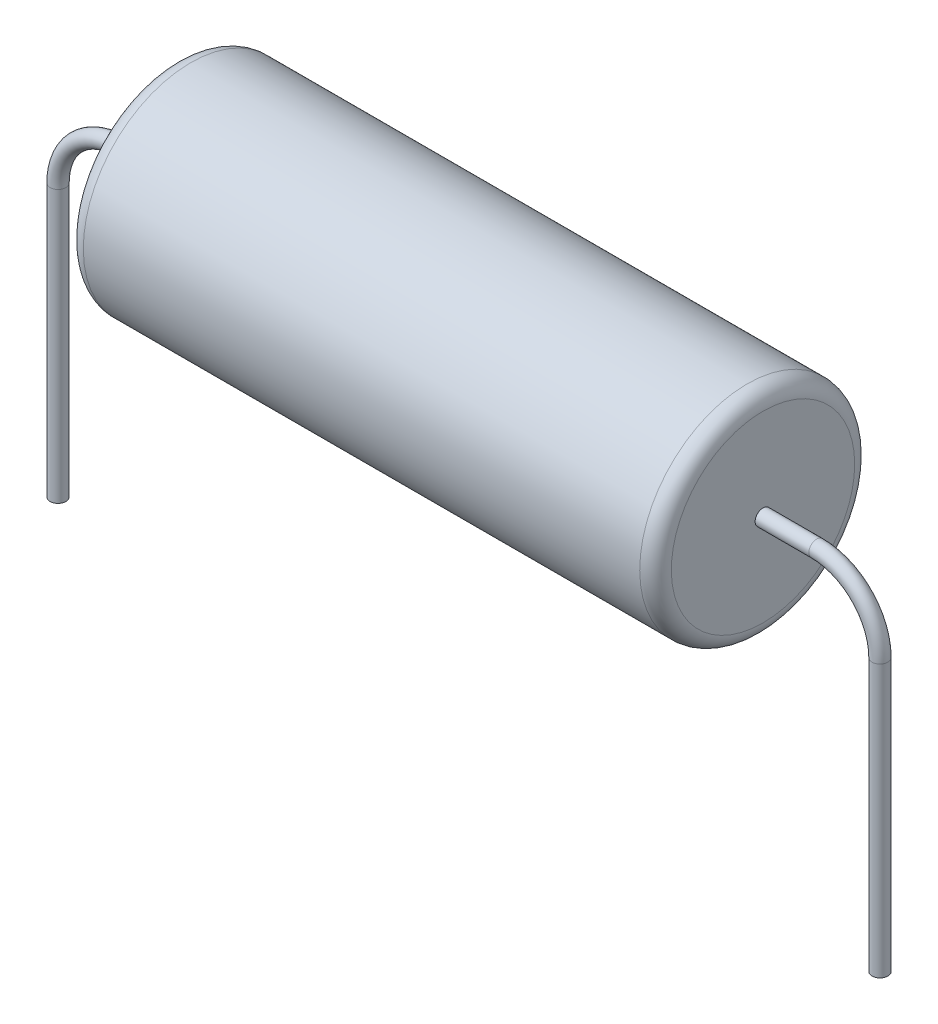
ISO-10303-21;
HEADER;
FILE_DESCRIPTION(('STEP AP214'),'2;1');
FILE_NAME('part.step','',(''),(''),'','','');
FILE_SCHEMA(('AUTOMOTIVE_DESIGN { 1 0 10303 214 1 1 1 1 }'));
ENDSEC;
DATA;
#1=APPLICATION_CONTEXT('core data for automotive mechanical design processes');
#2=APPLICATION_PROTOCOL_DEFINITION('international standard','automotive_design',2000,#1);
#3=PRODUCT_CONTEXT('',#1,'mechanical');
#4=PRODUCT('Part','Part','',(#3));
#5=PRODUCT_RELATED_PRODUCT_CATEGORY('part','',(#4));
#6=PRODUCT_DEFINITION_FORMATION('','',#4);
#7=PRODUCT_DEFINITION_CONTEXT('part definition',#1,'design');
#8=PRODUCT_DEFINITION('design','',#6,#7);
#9=PRODUCT_DEFINITION_SHAPE('','',#8);
#10=(LENGTH_UNIT() NAMED_UNIT(*) SI_UNIT(.MILLI.,.METRE.));
#11=(NAMED_UNIT(*) PLANE_ANGLE_UNIT() SI_UNIT($,.RADIAN.));
#12=(NAMED_UNIT(*) SI_UNIT($,.STERADIAN.) SOLID_ANGLE_UNIT());
#13=UNCERTAINTY_MEASURE_WITH_UNIT(LENGTH_MEASURE(1.E-05),#10,'distance_accuracy_value','');
#14=(GEOMETRIC_REPRESENTATION_CONTEXT(3) GLOBAL_UNCERTAINTY_ASSIGNED_CONTEXT((#13)) GLOBAL_UNIT_ASSIGNED_CONTEXT((#10,
#11,#12)) REPRESENTATION_CONTEXT('',''));
#15=CARTESIAN_POINT('',(0.,0.,0.));
#16=DIRECTION('',(0.,0.,1.));
#17=DIRECTION('',(1.,0.,0.));
#18=AXIS2_PLACEMENT_3D('',#15,#16,#17);
#19=CARTESIAN_POINT('',(43.0363364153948,0.,-43.5456413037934));
#20=DIRECTION('',(0.,1.,0.));
#21=DIRECTION('',(-1.,0.,0.));
#22=AXIS2_PLACEMENT_3D('',#19,#20,#21);
#23=PLANE('',#22);
#24=CARTESIAN_POINT('',(42.672,0.,-43.18));
#25=DIRECTION('',(0.,1.,0.));
#26=DIRECTION('',(0.,0.,1.));
#27=AXIS2_PLACEMENT_3D('',#24,#25,#26);
#28=CIRCLE('',#27,0.317500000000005);
#29=CARTESIAN_POINT('',(42.672,0.,-42.8625));
#30=VERTEX_POINT('',#29);
#31=EDGE_CURVE('E101',#30,#30,#28,.F.);
#32=ORIENTED_EDGE('',*,*,#31,.T.);
#33=EDGE_LOOP('',(#32));
#34=FACE_BOUND('',#33,.T.);
#35=ADVANCED_FACE('F16',(#34),#23,.F.);
#36=CARTESIAN_POINT('',(42.672,0.,-43.18));
#37=DIRECTION('',(0.,1.,0.));
#38=DIRECTION('',(0.,0.,1.));
#39=AXIS2_PLACEMENT_3D('',#36,#37,#38);
#40=CYLINDRICAL_SURFACE('',#39,0.317500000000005);
#41=CARTESIAN_POINT('',(42.672,10.9219999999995,-43.18));
#42=DIRECTION('',(-2.07068036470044E-13,-1.,0.));
#43=DIRECTION('',(0.989139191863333,-2.04819110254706E-13,-0.146981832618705));
#44=AXIS2_PLACEMENT_3D('',#41,#42,#43);
#45=CIRCLE('',#44,0.3175);
#46=CARTESIAN_POINT('',(42.9860516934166,10.9219999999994,-43.2266667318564));
#47=VERTEX_POINT('',#46);
#48=EDGE_CURVE('E99',#47,#47,#45,.T.);
#49=ORIENTED_EDGE('',*,*,#48,.T.);
#50=EDGE_LOOP('',(#49));
#51=FACE_BOUND('',#50,.T.);
#52=ORIENTED_EDGE('',*,*,#31,.F.);
#53=EDGE_LOOP('',(#52));
#54=FACE_BOUND('',#53,.T.);
#55=ADVANCED_FACE('F84',(#51,#54),#40,.T.);
#56=CARTESIAN_POINT('',(40.132,10.922,-43.18));
#57=DIRECTION('',(0.,0.,1.));
#58=DIRECTION('',(-1.,0.,0.));
#59=AXIS2_PLACEMENT_3D('',#56,#57,#58);
#60=TOROIDAL_SURFACE('',#59,2.54000000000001,0.3175);
#61=CARTESIAN_POINT('',(40.132,13.462,-43.18));
#62=DIRECTION('',(-1.,0.,0.));
#63=DIRECTION('',(0.,-1.,0.));
#64=AXIS2_PLACEMENT_3D('',#61,#62,#63);
#65=CIRCLE('',#64,0.317500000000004);
#66=CARTESIAN_POINT('',(40.132,13.1445,-43.18));
#67=VERTEX_POINT('',#66);
#68=EDGE_CURVE('E97',#67,#67,#65,.F.);
#69=ORIENTED_EDGE('',*,*,#68,.T.);
#70=EDGE_LOOP('',(#69));
#71=FACE_BOUND('',#70,.T.);
#72=ORIENTED_EDGE('',*,*,#48,.F.);
#73=EDGE_LOOP('',(#72));
#74=FACE_BOUND('',#73,.T.);
#75=ADVANCED_FACE('F80',(#71,#74),#60,.T.);
#76=CARTESIAN_POINT('',(9.28766358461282,0.,-43.5456413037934));
#77=DIRECTION('',(0.,-1.,0.));
#78=DIRECTION('',(1.,0.,0.));
#79=AXIS2_PLACEMENT_3D('',#76,#77,#78);
#80=PLANE('',#79);
#81=CARTESIAN_POINT('',(9.652,3.46944695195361E-13,-43.18));
#82=DIRECTION('',(0.,-1.,0.));
#83=DIRECTION('',(0.,0.,-1.));
#84=AXIS2_PLACEMENT_3D('',#81,#82,#83);
#85=CIRCLE('',#84,0.3175);
#86=CARTESIAN_POINT('',(9.652,3.46944695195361E-13,-43.4975));
#87=VERTEX_POINT('',#86);
#88=EDGE_CURVE('E104',#87,#87,#85,.T.);
#89=ORIENTED_EDGE('',*,*,#88,.T.);
#90=EDGE_LOOP('',(#89));
#91=FACE_BOUND('',#90,.T.);
#92=ADVANCED_FACE('F75',(#91),#80,.T.);
#93=CARTESIAN_POINT('',(40.132,13.462,-43.18));
#94=DIRECTION('',(-1.,0.,0.));
#95=DIRECTION('',(0.,0.,1.));
#96=AXIS2_PLACEMENT_3D('',#93,#94,#95);
#97=CYLINDRICAL_SURFACE('',#96,0.317500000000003);
#98=ORIENTED_EDGE('',*,*,#68,.F.);
#99=EDGE_LOOP('',(#98));
#100=FACE_BOUND('',#99,.T.);
#101=CARTESIAN_POINT('',(37.973,13.462,-43.18));
#102=DIRECTION('',(-1.,0.,0.));
#103=DIRECTION('',(0.,0.,1.));
#104=AXIS2_PLACEMENT_3D('',#101,#102,#103);
#105=CIRCLE('',#104,0.317500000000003);
#106=CARTESIAN_POINT('',(37.973,13.462,-42.8625));
#107=VERTEX_POINT('',#106);
#108=EDGE_CURVE('E159',#107,#107,#105,.T.);
#109=ORIENTED_EDGE('',*,*,#108,.F.);
#110=EDGE_LOOP('',(#109));
#111=FACE_BOUND('',#110,.T.);
#112=ADVANCED_FACE('F79',(#100,#111),#97,.T.);
#113=CARTESIAN_POINT('',(9.652,10.922,-43.18));
#114=DIRECTION('',(0.,-1.,0.));
#115=DIRECTION('',(0.,0.,-1.));
#116=AXIS2_PLACEMENT_3D('',#113,#114,#115);
#117=CYLINDRICAL_SURFACE('',#116,0.3175);
#118=ORIENTED_EDGE('',*,*,#88,.F.);
#119=EDGE_LOOP('',(#118));
#120=FACE_BOUND('',#119,.T.);
#121=CARTESIAN_POINT('',(9.652,10.9220000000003,-43.18));
#122=DIRECTION('',(1.03212393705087E-13,1.,0.));
#123=DIRECTION('',(0.989139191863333,-1.0209142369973E-13,0.146981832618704));
#124=AXIS2_PLACEMENT_3D('',#121,#122,#123);
#125=CIRCLE('',#124,0.3175);
#126=CARTESIAN_POINT('',(9.96605169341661,10.9220000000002,-43.1333332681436));
#127=VERTEX_POINT('',#126);
#128=EDGE_CURVE('E52',#127,#127,#125,.F.);
#129=ORIENTED_EDGE('',*,*,#128,.T.);
#130=EDGE_LOOP('',(#129));
#131=FACE_BOUND('',#130,.T.);
#132=ADVANCED_FACE('F73',(#120,#131),#117,.T.);
#133=CARTESIAN_POINT('',(37.973,17.29232,-39.3458357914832));
#134=DIRECTION('',(1.,0.,0.));
#135=DIRECTION('',(0.,-1.,0.));
#136=AXIS2_PLACEMENT_3D('',#133,#134,#135);
#137=PLANE('',#136);
#138=ORIENTED_EDGE('',*,*,#108,.T.);
#139=EDGE_LOOP('',(#138));
#140=FACE_BOUND('',#139,.T.);
#141=CARTESIAN_POINT('',(37.973,13.462,-43.18));
#142=DIRECTION('',(-1.,0.,0.));
#143=DIRECTION('',(0.,1.,-7.53613239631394E-13));
#144=AXIS2_PLACEMENT_3D('',#141,#142,#143);
#145=CIRCLE('',#144,3.68300000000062);
#146=CARTESIAN_POINT('',(37.973,9.77899999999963,-43.1799999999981));
#147=VERTEX_POINT('',#146);
#148=CARTESIAN_POINT('',(37.973,17.1450000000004,-43.1800000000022));
#149=VERTEX_POINT('',#148);
#150=EDGE_CURVE('E48',#147,#149,#145,.F.);
#151=ORIENTED_EDGE('',*,*,#150,.T.);
#152=CARTESIAN_POINT('',(37.973,9.77899999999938,-43.1799999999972));
#153=CARTESIAN_POINT('',(37.973,9.77899966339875,-43.1546265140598));
#154=CARTESIAN_POINT('',(37.9729999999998,9.77926165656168,-43.1292530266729));
#155=CARTESIAN_POINT('',(37.9729999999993,9.78031000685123,-43.0785168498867));
#156=CARTESIAN_POINT('',(37.9729999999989,9.78109636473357,-43.0531541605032));
#157=CARTESIAN_POINT('',(37.9729999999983,9.78319315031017,-43.0024504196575));
#158=CARTESIAN_POINT('',(37.972999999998,9.78450357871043,-42.9771093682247));
#159=CARTESIAN_POINT('',(37.9729999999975,9.78764792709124,-42.926459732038));
#160=CARTESIAN_POINT('',(37.9729999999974,9.78948184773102,-42.9011511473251));
#161=CARTESIAN_POINT('',(37.9729999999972,9.79367239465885,-42.8505772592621));
#162=CARTESIAN_POINT('',(37.9729999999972,9.79602902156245,-42.825311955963));
#163=CARTESIAN_POINT('',(37.9729999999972,9.80126396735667,-42.774835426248));
#164=CARTESIAN_POINT('',(37.9729999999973,9.80414228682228,-42.7496241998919));
#165=CARTESIAN_POINT('',(37.9729999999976,9.81041938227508,-42.6992665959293));
#166=CARTESIAN_POINT('',(37.9729999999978,9.81381815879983,-42.6741202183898));
#167=CARTESIAN_POINT('',(37.9729999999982,9.82113471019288,-42.6239030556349));
#168=CARTESIAN_POINT('',(37.9729999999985,9.82505248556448,-42.5988322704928));
#169=CARTESIAN_POINT('',(37.9729999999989,9.83340535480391,-42.5487770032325));
#170=CARTESIAN_POINT('',(37.9729999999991,9.83784044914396,-42.5237925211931));
#171=CARTESIAN_POINT('',(37.9729999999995,9.84722605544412,-42.4739205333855));
#172=CARTESIAN_POINT('',(37.9729999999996,9.85217656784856,-42.4490330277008));
#173=CARTESIAN_POINT('',(37.9729999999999,9.86259088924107,-42.399365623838));
#174=CARTESIAN_POINT('',(37.9729999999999,9.86805469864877,-42.3745857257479));
#175=CARTESIAN_POINT('',(37.973,9.87949327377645,-42.3251441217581));
#176=CARTESIAN_POINT('',(37.973,9.88546803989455,-42.3004824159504));
#177=CARTESIAN_POINT('',(37.9729999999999,9.8979259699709,-42.2512877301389));
#178=CARTESIAN_POINT('',(37.9729999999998,9.90440913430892,-42.2267547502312));
#179=CARTESIAN_POINT('',(37.9729999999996,9.91788108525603,-42.177827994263));
#180=CARTESIAN_POINT('',(37.9729999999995,9.92486987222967,-42.1534342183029));
#181=CARTESIAN_POINT('',(37.9729999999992,9.93935007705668,-42.1047962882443));
#182=CARTESIAN_POINT('',(37.9729999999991,9.94684149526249,-42.0805521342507));
#183=CARTESIAN_POINT('',(37.9729999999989,9.96232375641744,-42.0322238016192));
#184=CARTESIAN_POINT('',(37.9729999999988,9.97031459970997,-42.0081396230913));
#185=CARTESIAN_POINT('',(37.9729999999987,9.98679229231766,-41.9601415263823));
#186=CARTESIAN_POINT('',(37.9729999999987,9.99527914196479,-41.9362276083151));
#187=CARTESIAN_POINT('',(37.9729999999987,10.0127452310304,-41.8885802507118));
#188=CARTESIAN_POINT('',(37.9729999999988,10.0217244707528,-41.864846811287));
#189=CARTESIAN_POINT('',(37.9729999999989,10.0401715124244,-41.8175705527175));
#190=CARTESIAN_POINT('',(37.972999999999,10.0496393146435,-41.7940277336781));
#191=CARTESIAN_POINT('',(37.9729999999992,10.069059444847,-41.7471427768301));
#192=CARTESIAN_POINT('',(37.9729999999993,10.0790117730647,-41.723800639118));
#193=CARTESIAN_POINT('',(37.9729999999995,10.0993967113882,-41.6773270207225));
#194=CARTESIAN_POINT('',(37.9729999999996,10.1098293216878,-41.6541955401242));
#195=CARTESIAN_POINT('',(37.9729999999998,10.1311703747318,-41.608153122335));
#196=CARTESIAN_POINT('',(37.9729999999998,10.1420788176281,-41.5852421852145));
#197=CARTESIAN_POINT('',(37.9729999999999,10.1643668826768,-41.5396506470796));
#198=CARTESIAN_POINT('',(37.9729999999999,10.1757465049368,-41.5169700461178));
#199=CARTESIAN_POINT('',(37.973,10.1989720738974,-41.47184887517));
#200=CARTESIAN_POINT('',(37.973,10.2108180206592,-41.4494083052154));
#201=CARTESIAN_POINT('',(37.973,10.2349711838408,-41.4047767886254));
#202=CARTESIAN_POINT('',(37.973,10.24727840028,-41.3825858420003));
#203=CARTESIAN_POINT('',(37.973,10.2723488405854,-41.338463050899));
#204=CARTESIAN_POINT('',(37.973,10.2851120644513,-41.3165312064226));
#205=CARTESIAN_POINT('',(37.973,10.3110890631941,-41.2729359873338));
#206=CARTESIAN_POINT('',(37.973,10.3243028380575,-41.2512726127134));
#207=CARTESIAN_POINT('',(37.973,10.3511752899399,-41.2082235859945));
#208=CARTESIAN_POINT('',(37.973,10.3648339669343,-41.1868379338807));
#209=CARTESIAN_POINT('',(37.973,10.3925903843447,-41.1443534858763));
#210=CARTESIAN_POINT('',(37.973,10.4066881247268,-41.1232546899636));
#211=CARTESIAN_POINT('',(37.973,10.4353166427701,-41.0813529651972));
#212=CARTESIAN_POINT('',(37.973,10.4498474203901,-41.0605500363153));
#213=CARTESIAN_POINT('',(37.9729999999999,10.4793358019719,-41.0192489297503));
#214=CARTESIAN_POINT('',(37.9729999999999,10.4942934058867,-40.9987507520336));
#215=CARTESIAN_POINT('',(37.9729999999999,10.5246290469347,-40.9580679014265));
#216=CARTESIAN_POINT('',(37.9729999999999,10.5400070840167,-40.937883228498));
#217=CARTESIAN_POINT('',(37.9729999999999,10.5711770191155,-40.8978360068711));
#218=CARTESIAN_POINT('',(37.9729999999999,10.5869689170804,-40.8779734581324));
#219=CARTESIAN_POINT('',(37.9729999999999,10.618959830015,-40.8385789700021));
#220=CARTESIAN_POINT('',(37.9729999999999,10.6351588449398,-40.8190470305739));
#221=CARTESIAN_POINT('',(37.9729999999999,10.6679570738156,-40.7803221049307));
#222=CARTESIAN_POINT('',(37.9729999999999,10.6845562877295,-40.7611291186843));
#223=CARTESIAN_POINT('',(37.9729999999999,10.7181478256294,-40.7230902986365));
#224=CARTESIAN_POINT('',(37.9729999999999,10.7351401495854,-40.7042444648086));
#225=CARTESIAN_POINT('',(37.9729999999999,10.7695106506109,-40.6669080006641));
#226=CARTESIAN_POINT('',(37.9729999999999,10.7868888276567,-40.6484173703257));
#227=CARTESIAN_POINT('',(37.9729999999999,10.8220236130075,-40.6117992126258));
#228=CARTESIAN_POINT('',(37.9729999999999,10.8397802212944,-40.593671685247));
#229=CARTESIAN_POINT('',(37.9729999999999,10.8756642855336,-40.5577874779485));
#230=CARTESIAN_POINT('',(37.973,10.8937917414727,-40.5400307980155));
#231=CARTESIAN_POINT('',(37.973,10.930409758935,-40.504895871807));
#232=CARTESIAN_POINT('',(37.973,10.9489003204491,-40.487517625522));
#233=CARTESIAN_POINT('',(37.973,10.9862366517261,-40.4531469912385));
#234=CARTESIAN_POINT('',(37.973,11.005082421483,-40.4361546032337));
#235=CARTESIAN_POINT('',(37.973,11.0431211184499,-40.4025629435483));
#236=CARTESIAN_POINT('',(37.973,11.0623140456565,-40.3859636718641));
#237=CARTESIAN_POINT('',(37.973,11.1010388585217,-40.3531653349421));
#238=CARTESIAN_POINT('',(37.973,11.1205707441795,-40.3369662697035));
#239=CARTESIAN_POINT('',(37.973,11.1599651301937,-40.304975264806));
#240=CARTESIAN_POINT('',(37.973,11.1798276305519,-40.2891833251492));
#241=CARTESIAN_POINT('',(37.973,11.2198747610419,-40.2580133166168));
#242=CARTESIAN_POINT('',(37.973,11.240059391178,-40.2426352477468));
#243=CARTESIAN_POINT('',(37.973,11.2807421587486,-40.2122995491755));
#244=CARTESIAN_POINT('',(37.973,11.3012402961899,-40.1973419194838));
#245=CARTESIAN_POINT('',(37.973,11.3425413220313,-40.1678534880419));
#246=CARTESIAN_POINT('',(37.973,11.363344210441,-40.1533226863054));
#247=CARTESIAN_POINT('',(37.973,11.4052458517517,-40.1246941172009));
#248=CARTESIAN_POINT('',(37.973,11.426344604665,-40.1105963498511));
#249=CARTESIAN_POINT('',(37.973,11.468828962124,-40.0828398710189));
#250=CARTESIAN_POINT('',(37.973,11.4902145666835,-40.0691811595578));
#251=CARTESIAN_POINT('',(37.973,11.5332634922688,-40.0423086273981));
#252=CARTESIAN_POINT('',(37.973,11.5549268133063,-40.0290948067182));
#253=CARTESIAN_POINT('',(37.973,11.5985219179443,-40.0031177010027));
#254=CARTESIAN_POINT('',(37.973,11.6204537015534,-39.9903544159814));
#255=CARTESIAN_POINT('',(37.973,11.6645763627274,-39.9652838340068));
#256=CARTESIAN_POINT('',(37.973,11.686767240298,-39.9529765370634));
#257=CARTESIAN_POINT('',(37.973,11.7313986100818,-39.9288231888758));
#258=CARTESIAN_POINT('',(37.973,11.7538391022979,-39.9169771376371));
#259=CARTESIAN_POINT('',(37.973,11.7989601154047,-39.8937513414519));
#260=CARTESIAN_POINT('',(37.973,11.8216406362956,-39.8823715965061));
#261=CARTESIAN_POINT('',(37.973,11.8672320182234,-39.8600832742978));
#262=CARTESIAN_POINT('',(37.973,11.8901428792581,-39.8491746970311));
#263=CARTESIAN_POINT('',(37.973,11.9361851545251,-39.8278333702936));
#264=CARTESIAN_POINT('',(37.973,11.9593165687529,-39.8174006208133));
#265=CARTESIAN_POINT('',(37.973,12.0057900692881,-39.7970154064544));
#266=CARTESIAN_POINT('',(37.973,12.0291321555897,-39.7870629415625));
#267=CARTESIAN_POINT('',(37.973,12.076017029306,-39.7676425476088));
#268=CARTESIAN_POINT('',(37.973,12.099559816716,-39.7581746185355));
#269=CARTESIAN_POINT('',(37.973,12.1468360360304,-39.7397273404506));
#270=CARTESIAN_POINT('',(37.973,12.1705694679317,-39.7307479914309));
#271=CARTESIAN_POINT('',(37.973,12.2182168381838,-39.7132817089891));
#272=CARTESIAN_POINT('',(37.973,12.242130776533,-39.7047947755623));
#273=CARTESIAN_POINT('',(37.973,12.2901289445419,-39.6883169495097));
#274=CARTESIAN_POINT('',(37.973,12.3142131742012,-39.6803260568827));
#275=CARTESIAN_POINT('',(37.973,12.362541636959,-39.6648437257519));
#276=CARTESIAN_POINT('',(37.973,12.3867858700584,-39.6573522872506));
#277=CARTESIAN_POINT('',(37.973,12.4354239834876,-39.6428720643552));
#278=CARTESIAN_POINT('',(37.973,12.4598178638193,-39.6358832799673));
#279=CARTESIAN_POINT('',(37.973,12.5087448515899,-39.6224113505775));
#280=CARTESIAN_POINT('',(37.973,12.5332779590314,-39.6159282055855));
#281=CARTESIAN_POINT('',(37.973,12.5824729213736,-39.6034703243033));
#282=CARTESIAN_POINT('',(37.973,12.6071347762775,-39.5974955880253));
#283=CARTESIAN_POINT('',(37.973,12.6565766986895,-39.5860570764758));
#284=CARTESIAN_POINT('',(37.973,12.6813567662,-39.5805933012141));
#285=CARTESIAN_POINT('',(37.973,12.7310245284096,-39.5701790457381));
#286=CARTESIAN_POINT('',(37.973,12.7559122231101,-39.5652285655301));
#287=CARTESIAN_POINT('',(37.973,12.8057846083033,-39.5558430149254));
#288=CARTESIAN_POINT('',(37.973,12.8307692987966,-39.5514079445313));
#289=CARTESIAN_POINT('',(37.973,12.8808250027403,-39.5430551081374));
#290=CARTESIAN_POINT('',(37.973,12.9058960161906,-39.5391373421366));
#291=CARTESIAN_POINT('',(37.973,12.9561136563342,-39.5318207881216));
#292=CARTESIAN_POINT('',(37.973,12.9812602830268,-39.5284220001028));
#293=CARTESIAN_POINT('',(37.973,13.0316184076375,-39.5221448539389));
#294=CARTESIAN_POINT('',(37.973,13.0568299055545,-39.5192664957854));
#295=CARTESIAN_POINT('',(37.973,13.1073070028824,-39.5140314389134));
#296=CARTESIAN_POINT('',(37.973,13.1325726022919,-39.5116747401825));
#297=CARTESIAN_POINT('',(37.973,13.1831471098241,-39.5074840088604));
#298=CARTESIAN_POINT('',(37.973,13.2084560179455,-39.5056499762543));
#299=CARTESIAN_POINT('',(37.973,13.2591063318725,-39.5025053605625));
#300=CARTESIAN_POINT('',(37.973,13.2844477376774,-39.5011947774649));
#301=CARTESIAN_POINT('',(37.973,13.3351522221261,-39.4990976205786));
#302=CARTESIAN_POINT('',(37.973,13.3605153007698,-39.498311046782));
#303=CARTESIAN_POINT('',(37.973,13.4112522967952,-39.4972622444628));
#304=CARTESIAN_POINT('',(37.973,13.4366262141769,-39.4970000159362));
#305=CARTESIAN_POINT('',(37.973,13.4873740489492,-39.4970000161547));
#306=CARTESIAN_POINT('',(37.973,13.5127479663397,-39.4972622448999));
#307=CARTESIAN_POINT('',(37.973,13.5634849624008,-39.4983110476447));
#308=CARTESIAN_POINT('',(37.973,13.5888480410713,-39.4990976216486));
#309=CARTESIAN_POINT('',(37.973,13.6395525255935,-39.5011947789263));
#310=CARTESIAN_POINT('',(37.973,13.6648939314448,-39.5025053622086));
#311=CARTESIAN_POINT('',(37.973,13.7155442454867,-39.5056499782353));
#312=CARTESIAN_POINT('',(37.973,13.7408531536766,-39.5074840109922));
#313=CARTESIAN_POINT('',(37.973,13.7914276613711,-39.5116747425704));
#314=CARTESIAN_POINT('',(37.973,13.8166932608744,-39.514031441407));
#315=CARTESIAN_POINT('',(37.973,13.8671703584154,-39.5192664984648));
#316=CARTESIAN_POINT('',(37.973,13.8923818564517,-39.5221448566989));
#317=CARTESIAN_POINT('',(37.973,13.9427399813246,-39.5284220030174));
#318=CARTESIAN_POINT('',(37.973,13.96788660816,-39.531820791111));
#319=CARTESIAN_POINT('',(37.973,14.0181042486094,-39.5391373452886));
#320=CARTESIAN_POINT('',(37.973,14.0431752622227,-39.5430551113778));
#321=CARTESIAN_POINT('',(37.973,14.0932309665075,-39.5514079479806));
#322=CARTESIAN_POINT('',(37.973,14.1182156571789,-39.5558430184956));
#323=CARTESIAN_POINT('',(37.973,14.1680880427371,-39.565228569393));
#324=CARTESIAN_POINT('',(37.973,14.1929757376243,-39.5701790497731));
#325=CARTESIAN_POINT('',(37.973,14.2426435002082,-39.5805933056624));
#326=CARTESIAN_POINT('',(37.973,14.2674235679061,-39.5860570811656));
#327=CARTESIAN_POINT('',(37.973,14.3168654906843,-39.5974955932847));
#328=CARTESIAN_POINT('',(37.973,14.3415273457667,-39.603470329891));
#329=CARTESIAN_POINT('',(37.973,14.3907223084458,-39.6159282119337));
#330=CARTESIAN_POINT('',(37.973,14.4152554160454,-39.622411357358));
#331=CARTESIAN_POINT('',(37.973,14.4641824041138,-39.6358832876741));
#332=CARTESIAN_POINT('',(37.973,14.4885762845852,-39.6428720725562));
#333=CARTESIAN_POINT('',(37.973,14.537214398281,-39.6573522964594));
#334=CARTESIAN_POINT('',(37.973,14.5614586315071,-39.6648437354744));
#335=CARTESIAN_POINT('',(37.973,14.6097870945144,-39.6803260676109));
#336=CARTESIAN_POINT('',(37.973,14.6338713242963,-39.6883169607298));
#337=CARTESIAN_POINT('',(37.973,14.6818694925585,-39.7047947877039));
#338=CARTESIAN_POINT('',(37.973,14.7057834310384,-39.7132817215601));
#339=CARTESIAN_POINT('',(37.973,14.7534308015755,-39.7307480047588));
#340=CARTESIAN_POINT('',(37.973,14.7771642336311,-39.7397273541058));
#341=CARTESIAN_POINT('',(37.973,14.8244404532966,-39.7581746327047));
#342=CARTESIAN_POINT('',(37.973,14.8479832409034,-39.7676425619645));
#343=CARTESIAN_POINT('',(37.973,14.8948681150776,-39.7870629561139));
#344=CARTESIAN_POINT('',(37.973,14.9182102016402,-39.7970154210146));
#345=CARTESIAN_POINT('',(37.973,14.9646837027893,-39.8174006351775));
#346=CARTESIAN_POINT('',(37.973,14.9878151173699,-39.8278333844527));
#347=CARTESIAN_POINT('',(37.973,15.0338573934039,-39.8491747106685));
#348=CARTESIAN_POINT('',(37.973,15.0567682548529,-39.8600832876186));
#349=CARTESIAN_POINT('',(37.973,15.1023596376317,-39.8823716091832));
#350=CARTESIAN_POINT('',(37.973,15.1250401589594,-39.893751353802));
#351=CARTESIAN_POINT('',(37.973,15.1701611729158,-39.9169771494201));
#352=CARTESIAN_POINT('',(37.973,15.1926016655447,-39.9288232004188));
#353=CARTESIAN_POINT('',(37.973,15.2372330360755,-39.9529765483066));
#354=CARTESIAN_POINT('',(37.973,15.2594239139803,-39.9652838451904));
#355=CARTESIAN_POINT('',(37.973,15.3035465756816,-39.990354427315));
#356=CARTESIAN_POINT('',(37.973,15.3254783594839,-40.0031177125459));
#357=CARTESIAN_POINT('',(37.973,15.369073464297,-40.0290948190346));
#358=CARTESIAN_POINT('',(37.973,15.3907367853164,-40.042308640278));
#359=CARTESIAN_POINT('',(37.973,15.4337857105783,-40.0691811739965));
#360=CARTESIAN_POINT('',(37.973,15.4551713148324,-40.082839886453));
#361=CARTESIAN_POINT('',(37.973,15.4976556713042,-40.1105963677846));
#362=CARTESIAN_POINT('',(37.973,15.5187544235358,-40.1246941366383));
#363=CARTESIAN_POINT('',(37.973,15.5606560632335,-40.1533227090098));
#364=CARTESIAN_POINT('',(37.973,15.5814589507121,-40.1678535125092));
#365=CARTESIAN_POINT('',(37.973,15.6227599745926,-40.1973419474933));
#366=CARTESIAN_POINT('',(37.973,15.6432581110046,-40.212299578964));
#367=CARTESIAN_POINT('',(37.973,15.6839408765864,-40.2426352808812));
#368=CARTESIAN_POINT('',(37.973,15.7041255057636,-40.2580133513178));
#369=CARTESIAN_POINT('',(37.973,15.7441726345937,-40.2891833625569));
#370=CARTESIAN_POINT('',(37.973,15.7640351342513,-40.3049753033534));
#371=CARTESIAN_POINT('',(37.973,15.8034295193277,-40.3369663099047));
#372=CARTESIAN_POINT('',(37.973,15.8229614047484,-40.3531653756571));
#373=CARTESIAN_POINT('',(37.973,15.8616862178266,-40.385963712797));
#374=CARTESIAN_POINT('',(37.973,15.8808791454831,-40.4025629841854));
#375=CARTESIAN_POINT('',(37.973,15.9189178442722,-40.4361546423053));
#376=CARTESIAN_POINT('',(37.973,15.9377636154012,-40.453147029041));
#377=CARTESIAN_POINT('',(37.973,15.9750999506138,-40.4875176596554));
#378=CARTESIAN_POINT('',(37.973,15.993590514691,-40.5048959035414));
#379=CARTESIAN_POINT('',(37.973,16.0302085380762,-40.5400308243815));
#380=CARTESIAN_POINT('',(37.973,16.0483359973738,-40.5577875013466));
#381=CARTESIAN_POINT('',(37.973,16.0842200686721,-40.5936717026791));
#382=CARTESIAN_POINT('',(37.973,16.1019766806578,-40.6117992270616));
#383=CARTESIAN_POINT('',(37.973,16.1371114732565,-40.6484173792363));
#384=CARTESIAN_POINT('',(37.973,16.1544896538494,-40.6669080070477));
#385=CARTESIAN_POINT('',(37.973,16.1888601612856,-40.7042444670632));
#386=CARTESIAN_POINT('',(37.973,16.2058524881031,-40.7230902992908));
#387=CARTESIAN_POINT('',(37.973,16.2394440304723,-40.7611291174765));
#388=CARTESIAN_POINT('',(37.973,16.2560432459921,-40.7803221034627));
#389=CARTESIAN_POINT('',(37.973,16.2888414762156,-40.8190470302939));
#390=CARTESIAN_POINT('',(37.973,16.3050404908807,-40.8385789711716));
#391=CARTESIAN_POINT('',(37.973,16.3370314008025,-40.8779734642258));
#392=CARTESIAN_POINT('',(37.973,16.3528232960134,-40.8978360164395));
#393=CARTESIAN_POINT('',(37.973,16.3839932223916,-40.9378832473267));
#394=CARTESIAN_POINT('',(37.973,16.3993712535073,-40.9580679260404));
#395=CARTESIAN_POINT('',(37.973,16.4297068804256,-40.9987507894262));
#396=CARTESIAN_POINT('',(37.973,16.4446644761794,-41.0192489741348));
#397=CARTESIAN_POINT('',(37.973,16.4741528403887,-41.0605500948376));
#398=CARTESIAN_POINT('',(37.973,16.4886836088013,-41.0813530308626));
#399=CARTESIAN_POINT('',(37.973,16.517312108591,-41.1232547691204));
#400=CARTESIAN_POINT('',(37.973,16.5314098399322,-41.1443535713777));
#401=CARTESIAN_POINT('',(37.973,16.5591662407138,-41.186838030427));
#402=CARTESIAN_POINT('',(37.973,16.5728249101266,-41.2082236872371));
#403=CARTESIAN_POINT('',(37.973,16.5996973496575,-41.2512727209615));
#404=CARTESIAN_POINT('',(37.973,16.6129111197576,-41.272936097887));
#405=CARTESIAN_POINT('',(37.973,16.6388881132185,-41.316531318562));
#406=CARTESIAN_POINT('',(37.973,16.6516513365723,-41.3384631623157));
#407=CARTESIAN_POINT('',(37.973,16.676721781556,-41.3825859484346));
#408=CARTESIAN_POINT('',(37.973,16.6890290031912,-41.4047768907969));
#409=CARTESIAN_POINT('',(37.973,16.7131821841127,-41.4494083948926));
#410=CARTESIAN_POINT('',(37.973,16.725028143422,-41.4718489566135));
#411=CARTESIAN_POINT('',(37.973,16.7482537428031,-41.5169701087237));
#412=CARTESIAN_POINT('',(37.973,16.7596333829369,-41.5396506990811));
#413=CARTESIAN_POINT('',(37.973,16.7819214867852,-41.5852422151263));
#414=CARTESIAN_POINT('',(37.9729999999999,16.7928299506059,-41.6081531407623));
#415=CARTESIAN_POINT('',(37.9729999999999,16.8141710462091,-41.6541955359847));
#416=CARTESIAN_POINT('',(37.9729999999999,16.8246036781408,-41.6773270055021));
#417=CARTESIAN_POINT('',(37.9729999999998,16.8449886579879,-41.7238006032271));
#418=CARTESIAN_POINT('',(37.9729999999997,16.8549410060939,-41.7471427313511));
#419=CARTESIAN_POINT('',(37.9729999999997,16.8743611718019,-41.7940276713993));
#420=CARTESIAN_POINT('',(37.9729999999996,16.8838289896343,-41.817570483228));
#421=CARTESIAN_POINT('',(37.9729999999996,16.9022760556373,-41.8648467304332));
#422=CARTESIAN_POINT('',(37.9729999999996,16.9112553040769,-41.8885801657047));
#423=CARTESIAN_POINT('',(37.9729999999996,16.928721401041,-41.9362275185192));
#424=CARTESIAN_POINT('',(37.9729999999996,16.9372082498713,-41.9601414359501));
#425=CARTESIAN_POINT('',(37.9729999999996,16.9536859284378,-42.0081395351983));
#426=CARTESIAN_POINT('',(37.9729999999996,16.9616767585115,-42.0322237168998));
#427=CARTESIAN_POINT('',(37.9729999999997,16.9771589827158,-42.0805520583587));
#428=CARTESIAN_POINT('',(37.9729999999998,16.9846503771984,-42.1047962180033));
#429=CARTESIAN_POINT('',(37.9729999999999,16.999130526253,-42.1534341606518));
#430=CARTESIAN_POINT('',(37.9729999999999,17.0061192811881,-42.1778279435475));
#431=CARTESIAN_POINT('',(37.973,17.0195911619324,-42.2267547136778));
#432=CARTESIAN_POINT('',(37.973,17.0260742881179,-42.2512877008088));
#433=CARTESIAN_POINT('',(37.973,17.0385321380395,-42.3004824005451));
#434=CARTESIAN_POINT('',(37.973,17.0445068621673,-42.3251441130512));
#435=CARTESIAN_POINT('',(37.9729999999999,17.0559453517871,-42.3745857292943));
#436=CARTESIAN_POINT('',(37.9729999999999,17.0614091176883,-42.3993656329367));
#437=CARTESIAN_POINT('',(37.9729999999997,17.0718233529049,-42.4490330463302));
#438=CARTESIAN_POINT('',(37.9729999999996,17.0767738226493,-42.4739205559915));
#439=CARTESIAN_POINT('',(37.9729999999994,17.0861593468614,-42.5237925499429));
#440=CARTESIAN_POINT('',(37.9729999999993,17.0905944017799,-42.5487770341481));
#441=CARTESIAN_POINT('',(37.9729999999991,17.0989471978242,-42.59883230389));
#442=CARTESIAN_POINT('',(37.972999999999,17.1028649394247,-42.6239030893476));
#443=CARTESIAN_POINT('',(37.9729999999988,17.1101814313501,-42.6741202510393));
#444=CARTESIAN_POINT('',(37.9729999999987,17.113580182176,-42.6992666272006));
#445=CARTESIAN_POINT('',(37.9729999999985,17.1198572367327,-42.749624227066));
#446=CARTESIAN_POINT('',(37.9729999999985,17.1227355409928,-42.7748354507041));
#447=CARTESIAN_POINT('',(37.9729999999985,17.1279704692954,-42.8253119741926));
#448=CARTESIAN_POINT('',(37.9729999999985,17.1303270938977,-42.850577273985));
#449=CARTESIAN_POINT('',(37.9729999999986,17.1345176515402,-42.9011511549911));
#450=CARTESIAN_POINT('',(37.9729999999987,17.1363515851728,-42.9264597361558));
#451=CARTESIAN_POINT('',(37.972999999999,17.1394959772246,-42.9771093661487));
#452=CARTESIAN_POINT('',(37.9729999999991,17.1408064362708,-43.002450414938));
#453=CARTESIAN_POINT('',(37.9729999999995,17.1429033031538,-43.05315415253));
#454=CARTESIAN_POINT('',(37.9729999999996,17.1436897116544,-43.0785168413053));
#455=CARTESIAN_POINT('',(37.9729999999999,17.1447381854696,-43.1292530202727));
#456=CARTESIAN_POINT('',(37.973,17.1450002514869,-43.1546265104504));
#457=CARTESIAN_POINT('',(37.973,17.1450000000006,-43.180000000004));
#458=B_SPLINE_CURVE_WITH_KNOTS('',3,(#152,#153,#154,#155,#156,#157,#158,#159,#160,#161,#162,
#163,#164,#165,#166,#167,#168,#169,#170,#171,#172,#173,#174,#175,#176,#177,#178,#179,#180,#181,
#182,#183,#184,#185,#186,#187,#188,#189,#190,#191,#192,#193,#194,#195,#196,#197,#198,#199,#200,
#201,#202,#203,#204,#205,#206,#207,#208,#209,#210,#211,#212,#213,#214,#215,#216,#217,#218,#219,
#220,#221,#222,#223,#224,#225,#226,#227,#228,#229,#230,#231,#232,#233,#234,#235,#236,#237,#238,
#239,#240,#241,#242,#243,#244,#245,#246,#247,#248,#249,#250,#251,#252,#253,#254,#255,#256,#257,
#258,#259,#260,#261,#262,#263,#264,#265,#266,#267,#268,#269,#270,#271,#272,#273,#274,#275,#276,
#277,#278,#279,#280,#281,#282,#283,#284,#285,#286,#287,#288,#289,#290,#291,#292,#293,#294,#295,
#296,#297,#298,#299,#300,#301,#302,#303,#304,#305,#306,#307,#308,#309,#310,#311,#312,#313,#314,
#315,#316,#317,#318,#319,#320,#321,#322,#323,#324,#325,#326,#327,#328,#329,#330,#331,#332,#333,
#334,#335,#336,#337,#338,#339,#340,#341,#342,#343,#344,#345,#346,#347,#348,#349,#350,#351,#352,
#353,#354,#355,#356,#357,#358,#359,#360,#361,#362,#363,#364,#365,#366,#367,#368,#369,#370,#371,
#372,#373,#374,#375,#376,#377,#378,#379,#380,#381,#382,#383,#384,#385,#386,#387,#388,#389,#390,
#391,#392,#393,#394,#395,#396,#397,#398,#399,#400,#401,#402,#403,#404,#405,#406,#407,#408,#409,
#410,#411,#412,#413,#414,#415,#416,#417,#418,#419,#420,#421,#422,#423,#424,#425,#426,#427,#428,
#429,#430,#431,#432,#433,#434,#435,#436,#437,#438,#439,#440,#441,#442,#443,#444,#445,#446,#447,
#448,#449,#450,#451,#452,#453,#454,#455,#456,#457),.UNSPECIFIED.,.F.,.F.,(4,2,2,2,2,2,2,2,2,2,2,
2,2,2,2,2,2,2,2,2,2,2,2,2,2,2,2,2,2,2,2,2,2,2,2,2,2,2,2,2,2,2,2,2,2,2,2,2,2,2,2,2,2,2,2,2,2,2,2,
2,2,2,2,2,2,2,2,2,2,2,2,2,2,2,2,2,2,2,2,2,2,2,2,2,2,2,2,2,2,2,2,2,2,2,2,2,2,2,2,2,2,2,2,2,2,2,2,
2,2,2,2,2,2,2,2,2,2,2,2,2,2,2,2,2,2,2,2,2,2,2,2,2,2,2,2,2,2,2,2,2,2,2,2,2,2,2,2,2,2,2,2,2,4),
(0.,0.0761190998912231,0.152238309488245,0.228357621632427,0.304477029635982,0.380596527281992,
0.456716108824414,0.532835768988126,0.608955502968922,0.685075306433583,0.761195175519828,
0.837315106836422,0.913435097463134,0.98955514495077,1.06567524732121,1.14179540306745,
1.21791561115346,1.29403587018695,1.37015617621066,1.44627652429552,1.5223969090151,
1.59851732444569,1.6746377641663,1.75075822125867,1.82687868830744,1.90299915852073,
1.9791196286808,2.05524009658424,2.13136056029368,2.20748101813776,2.28360146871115,
2.35972191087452,2.43584234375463,2.51196276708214,2.58808318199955,2.66420358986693,
2.74032399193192,2.81644438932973,2.89256478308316,2.96868517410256,3.04480556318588,
3.12092595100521,3.19704633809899,3.27316672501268,3.34928711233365,3.42540750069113,
3.50152789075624,3.577648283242,3.65376867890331,3.72988907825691,3.80600948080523,
3.88212988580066,3.95825029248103,4.03437070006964,4.11049110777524,4.186611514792,
4.2627319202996,4.33885232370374,4.41497272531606,4.4910931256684,4.56721352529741,
4.64333392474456,4.71945432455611,4.79557472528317,4.87169512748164,4.94781553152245,
5.02393593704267,5.1000563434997,5.17617675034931,5.2522971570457,5.32841756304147,
5.40453796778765,5.48065837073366,5.55677877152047,5.63289917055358,5.70901956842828,
5.78513996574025,5.86126036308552,5.93738076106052,6.01350116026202,6.0896215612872,
6.16574196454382,6.24186236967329,6.31798277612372,6.39410318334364,6.470223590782,
6.54634399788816,6.62246440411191,6.69858480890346,6.77470521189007,6.8508256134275,
6.92694601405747,7.00306641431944,7.07918681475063,7.15530721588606,7.23142761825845,
7.30754802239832,7.38366842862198,7.45978883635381,7.53590924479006,7.6120296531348,
7.68815006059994,7.76427046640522,7.84039086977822,7.91651126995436,7.99263166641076,
8.06875205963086,8.14487245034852,8.22099283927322,8.29711322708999,8.37323361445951,
8.44935400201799,8.52547439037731,8.60159478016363,8.67771517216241,8.75383556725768,
8.82995596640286,8.90607637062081,8.98219678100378,9.05831719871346,9.13443762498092,
9.21055806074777,9.28667850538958,9.36279895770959,9.43891941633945,9.51503987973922,
9.59116034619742,9.66728081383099,9.7434012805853,9.8195217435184,9.89564219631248,
9.97176263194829,10.0478830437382,10.1240034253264,10.2001237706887,10.2762440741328,
10.3523643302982,10.4284845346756,10.504604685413,10.5807247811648,10.6568448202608,
10.7329648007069,10.8090847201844,10.8852045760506,10.9613243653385,11.0374440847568,
11.1135637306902,11.1896832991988,11.2658027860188,11.3419221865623,11.418041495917,
11.4941607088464,11.5702798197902),.UNSPECIFIED.);
#459=EDGE_CURVE('E45',#149,#147,#458,.F.);
#460=ORIENTED_EDGE('',*,*,#459,.T.);
#461=EDGE_LOOP('',(#151,#460));
#462=FACE_BOUND('',#461,.T.);
#463=ADVANCED_FACE('F55',(#140,#462),#137,.T.);
#464=CARTESIAN_POINT('',(37.338,13.462,-43.18));
#465=DIRECTION('',(1.,0.,0.));
#466=DIRECTION('',(0.,0.999955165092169,-0.00946930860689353));
#467=AXIS2_PLACEMENT_3D('',#464,#465,#466);
#468=TOROIDAL_SURFACE('',#467,3.6830000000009,0.635);
#469=CARTESIAN_POINT('',(37.3379999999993,13.462,-43.18));
#470=DIRECTION('',(1.,0.,0.));
#471=DIRECTION('',(0.,-1.,0.));
#472=AXIS2_PLACEMENT_3D('',#469,#470,#471);
#473=CIRCLE('',#472,4.318);
#474=CARTESIAN_POINT('',(37.3379999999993,9.144,-43.18));
#475=VERTEX_POINT('',#474);
#476=EDGE_CURVE('E56',#475,#475,#473,.T.);
#477=ORIENTED_EDGE('',*,*,#476,.T.);
#478=EDGE_LOOP('',(#477));
#479=FACE_BOUND('',#478,.T.);
#480=ORIENTED_EDGE('',*,*,#150,.F.);
#481=ORIENTED_EDGE('',*,*,#459,.F.);
#482=EDGE_LOOP('',(#480,#481));
#483=FACE_BOUND('',#482,.T.);
#484=ADVANCED_FACE('F49',(#479,#483),#468,.T.);
#485=CARTESIAN_POINT('',(12.192,10.922,-43.18));
#486=DIRECTION('',(0.,0.,1.));
#487=DIRECTION('',(0.,-1.,0.));
#488=AXIS2_PLACEMENT_3D('',#485,#486,#487);
#489=TOROIDAL_SURFACE('',#488,2.54,0.3175);
#490=ORIENTED_EDGE('',*,*,#128,.F.);
#491=EDGE_LOOP('',(#490));
#492=FACE_BOUND('',#491,.T.);
#493=CARTESIAN_POINT('',(12.1920000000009,13.462,-43.18));
#494=DIRECTION('',(-1.,0.,0.));
#495=DIRECTION('',(0.,-1.,0.));
#496=AXIS2_PLACEMENT_3D('',#493,#494,#495);
#497=CIRCLE('',#496,0.317500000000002);
#498=CARTESIAN_POINT('',(12.1920000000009,13.1445,-43.18));
#499=VERTEX_POINT('',#498);
#500=EDGE_CURVE('E138',#499,#499,#497,.T.);
#501=ORIENTED_EDGE('',*,*,#500,.T.);
#502=EDGE_LOOP('',(#501));
#503=FACE_BOUND('',#502,.T.);
#504=ADVANCED_FACE('F146',(#492,#503),#489,.T.);
#505=CARTESIAN_POINT('',(14.986,13.462,-43.18));
#506=DIRECTION('',(1.,0.,0.));
#507=DIRECTION('',(0.,0.,-1.));
#508=AXIS2_PLACEMENT_3D('',#505,#506,#507);
#509=CYLINDRICAL_SURFACE('',#508,4.318);
#510=CARTESIAN_POINT('',(14.986,13.462,-43.18));
#511=DIRECTION('',(1.,0.,0.));
#512=DIRECTION('',(0.,-0.999909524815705,-0.0134514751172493));
#513=AXIS2_PLACEMENT_3D('',#510,#511,#512);
#514=CIRCLE('',#513,4.31800000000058);
#515=CARTESIAN_POINT('',(14.986,9.14439067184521,-43.2380834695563));
#516=VERTEX_POINT('',#515);
#517=EDGE_CURVE('E141',#516,#516,#514,.T.);
#518=ORIENTED_EDGE('',*,*,#517,.T.);
#519=EDGE_LOOP('',(#518));
#520=FACE_BOUND('',#519,.T.);
#521=ORIENTED_EDGE('',*,*,#476,.F.);
#522=EDGE_LOOP('',(#521));
#523=FACE_BOUND('',#522,.T.);
#524=ADVANCED_FACE('F128',(#520,#523),#509,.T.);
#525=CARTESIAN_POINT('',(14.986,13.462,-43.18));
#526=DIRECTION('',(1.,0.,0.));
#527=DIRECTION('',(0.,-0.999909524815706,-0.0134514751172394));
#528=AXIS2_PLACEMENT_3D('',#525,#526,#527);
#529=TOROIDAL_SURFACE('',#528,3.68300000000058,0.635);
#530=ORIENTED_EDGE('',*,*,#517,.F.);
#531=EDGE_LOOP('',(#530));
#532=FACE_BOUND('',#531,.T.);
#533=CARTESIAN_POINT('',(14.351,13.462,-43.18));
#534=DIRECTION('',(1.,0.,0.));
#535=DIRECTION('',(0.,-1.,3.88110818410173E-13));
#536=AXIS2_PLACEMENT_3D('',#533,#534,#535);
#537=CIRCLE('',#536,3.68300000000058);
#538=CARTESIAN_POINT('',(14.351,9.77899999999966,-43.1799999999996));
#539=VERTEX_POINT('',#538);
#540=CARTESIAN_POINT('',(14.351,17.1450000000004,-43.1800000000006));
#541=VERTEX_POINT('',#540);
#542=EDGE_CURVE('E112',#539,#541,#537,.T.);
#543=ORIENTED_EDGE('',*,*,#542,.T.);
#544=CARTESIAN_POINT('',(14.351,17.1450000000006,-43.1800000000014));
#545=CARTESIAN_POINT('',(14.351,17.1450002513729,-43.1546265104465));
#546=CARTESIAN_POINT('',(14.3510000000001,17.1447381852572,-43.1292530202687));
#547=CARTESIAN_POINT('',(14.3510000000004,17.1436897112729,-43.078516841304));
#548=CARTESIAN_POINT('',(14.3510000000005,17.1429033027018,-43.0531541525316));
#549=CARTESIAN_POINT('',(14.3510000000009,17.1408064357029,-43.0024504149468));
#550=CARTESIAN_POINT('',(14.351000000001,17.1394959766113,-42.9771093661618));
#551=CARTESIAN_POINT('',(14.3510000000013,17.1363515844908,-42.9264597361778));
#552=CARTESIAN_POINT('',(14.3510000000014,17.1345176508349,-42.9011511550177));
#553=CARTESIAN_POINT('',(14.3510000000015,17.1303270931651,-42.8505772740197));
#554=CARTESIAN_POINT('',(14.3510000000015,17.1279704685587,-42.825311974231));
#555=CARTESIAN_POINT('',(14.3510000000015,17.1227355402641,-42.774835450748));
#556=CARTESIAN_POINT('',(14.3510000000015,17.119857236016,-42.7496242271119));
#557=CARTESIAN_POINT('',(14.3510000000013,17.1135801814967,-42.6992666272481));
#558=CARTESIAN_POINT('',(14.3510000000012,17.110181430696,-42.6741202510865));
#559=CARTESIAN_POINT('',(14.351000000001,17.1028649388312,-42.6239030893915));
#560=CARTESIAN_POINT('',(14.3510000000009,17.098947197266,-42.598832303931));
#561=CARTESIAN_POINT('',(14.3510000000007,17.0905944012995,-42.5487770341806));
#562=CARTESIAN_POINT('',(14.3510000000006,17.0861593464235,-42.5237925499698));
#563=CARTESIAN_POINT('',(14.3510000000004,17.0767738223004,-42.4739205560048));
#564=CARTESIAN_POINT('',(14.3510000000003,17.0718233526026,-42.4490330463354));
#565=CARTESIAN_POINT('',(14.3510000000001,17.0614091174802,-42.3993656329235));
#566=CARTESIAN_POINT('',(14.3510000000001,17.0559453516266,-42.3745857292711));
#567=CARTESIAN_POINT('',(14.351,17.0445068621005,-42.3251441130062));
#568=CARTESIAN_POINT('',(14.351,17.0385321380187,-42.3004824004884));
#569=CARTESIAN_POINT('',(14.351,17.0260742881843,-42.2512877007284));
#570=CARTESIAN_POINT('',(14.351,17.0195911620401,-42.2267547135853));
#571=CARTESIAN_POINT('',(14.3510000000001,17.0061192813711,-42.1778279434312));
#572=CARTESIAN_POINT('',(14.3510000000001,16.9991305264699,-42.153434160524));
#573=CARTESIAN_POINT('',(14.3510000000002,16.9846503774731,-42.1047962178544));
#574=CARTESIAN_POINT('',(14.3510000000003,16.9771589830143,-42.0805520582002));
#575=CARTESIAN_POINT('',(14.3510000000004,16.9616767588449,-42.0322237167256));
#576=CARTESIAN_POINT('',(14.3510000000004,16.9536859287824,-42.0081395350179));
#577=CARTESIAN_POINT('',(14.3510000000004,16.937208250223,-41.9601414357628));
#578=CARTESIAN_POINT('',(14.3510000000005,16.9287214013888,-41.936227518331));
#579=CARTESIAN_POINT('',(14.3510000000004,16.9112553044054,-41.8885801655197));
#580=CARTESIAN_POINT('',(14.3510000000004,16.9022760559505,-41.8648467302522));
#581=CARTESIAN_POINT('',(14.3510000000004,16.8838289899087,-41.8175704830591));
#582=CARTESIAN_POINT('',(14.3510000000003,16.8743611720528,-41.7940276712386));
#583=CARTESIAN_POINT('',(14.3510000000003,16.8549410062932,-41.74714273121));
#584=CARTESIAN_POINT('',(14.3510000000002,16.8449886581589,-41.7238006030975));
#585=CARTESIAN_POINT('',(14.3510000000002,16.8246036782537,-41.6773270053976));
#586=CARTESIAN_POINT('',(14.3510000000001,16.8141710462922,-41.6541955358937));
#587=CARTESIAN_POINT('',(14.3510000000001,16.7928299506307,-41.6081531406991));
#588=CARTESIAN_POINT('',(14.351,16.7819214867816,-41.5852422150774));
#589=CARTESIAN_POINT('',(14.351,16.7596333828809,-41.5396506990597));
#590=CARTESIAN_POINT('',(14.351,16.7482537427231,-41.5169701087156));
#591=CARTESIAN_POINT('',(14.351,16.7250281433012,-41.471848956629));
#592=CARTESIAN_POINT('',(14.351,16.713182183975,-41.4494083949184));
#593=CARTESIAN_POINT('',(14.351,16.6890290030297,-41.4047768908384));
#594=CARTESIAN_POINT('',(14.351,16.6767217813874,-41.3825859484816));
#595=CARTESIAN_POINT('',(14.351,16.6516513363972,-41.338463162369));
#596=CARTESIAN_POINT('',(14.351,16.6388881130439,-41.3165313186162));
#597=CARTESIAN_POINT('',(14.351,16.6129111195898,-41.2729360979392));
#598=CARTESIAN_POINT('',(14.351,16.5996973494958,-41.2512727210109));
#599=CARTESIAN_POINT('',(14.351,16.5728249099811,-41.2082236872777));
#600=CARTESIAN_POINT('',(14.351,16.5591662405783,-41.1868380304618));
#601=CARTESIAN_POINT('',(14.351,16.5314098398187,-41.1443535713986));
#602=CARTESIAN_POINT('',(14.351,16.5173121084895,-41.1232547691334));
#603=CARTESIAN_POINT('',(14.351,16.4886836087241,-41.0813530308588));
#604=CARTESIAN_POINT('',(14.351,16.4741528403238,-41.0605500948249));
#605=CARTESIAN_POINT('',(14.351,16.4446644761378,-41.0192489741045));
#606=CARTESIAN_POINT('',(14.351,16.4297068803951,-40.9987507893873));
#607=CARTESIAN_POINT('',(14.351,16.3993712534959,-40.9580679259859));
#608=CARTESIAN_POINT('',(14.351,16.3839932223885,-40.9378832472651));
#609=CARTESIAN_POINT('',(14.351,16.3528232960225,-40.8978360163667));
#610=CARTESIAN_POINT('',(14.351,16.3370314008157,-40.877973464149));
#611=CARTESIAN_POINT('',(14.351,16.3050404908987,-40.8385789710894));
#612=CARTESIAN_POINT('',(14.351,16.2888414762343,-40.8190470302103));
#613=CARTESIAN_POINT('',(14.351,16.2560432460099,-40.7803221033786));
#614=CARTESIAN_POINT('',(14.351,16.2394440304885,-40.7611291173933));
#615=CARTESIAN_POINT('',(14.351,16.2058524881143,-40.7230902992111));
#616=CARTESIAN_POINT('',(14.351,16.1888601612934,-40.704244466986));
#617=CARTESIAN_POINT('',(14.351,16.1544896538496,-40.6669080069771));
#618=CARTESIAN_POINT('',(14.351,16.1371114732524,-40.6484173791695));
#619=CARTESIAN_POINT('',(14.351,16.1019766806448,-40.6117992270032));
#620=CARTESIAN_POINT('',(14.351,16.0842200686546,-40.5936717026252));
#621=CARTESIAN_POINT('',(14.351,16.0483359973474,-40.5577875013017));
#622=CARTESIAN_POINT('',(14.351,16.0302085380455,-40.5400308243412));
#623=CARTESIAN_POINT('',(14.351,15.9935905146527,-40.5048959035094));
#624=CARTESIAN_POINT('',(14.351,15.9750999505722,-40.4875176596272));
#625=CARTESIAN_POINT('',(14.351,15.9377636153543,-40.4531470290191));
#626=CARTESIAN_POINT('',(14.351,15.9189178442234,-40.4361546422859));
#627=CARTESIAN_POINT('',(14.351,15.8808791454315,-40.4025629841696));
#628=CARTESIAN_POINT('',(14.351,15.8616862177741,-40.3859637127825));
#629=CARTESIAN_POINT('',(14.351,15.822961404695,-40.3531653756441));
#630=CARTESIAN_POINT('',(14.351,15.8034295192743,-40.3369663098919));
#631=CARTESIAN_POINT('',(14.351,15.7640351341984,-40.3049753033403));
#632=CARTESIAN_POINT('',(14.351,15.7441726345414,-40.2891833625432));
#633=CARTESIAN_POINT('',(14.351,15.7041255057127,-40.2580133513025));
#634=CARTESIAN_POINT('',(14.351,15.6839408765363,-40.2426352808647));
#635=CARTESIAN_POINT('',(14.351,15.6432581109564,-40.212299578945));
#636=CARTESIAN_POINT('',(14.351,15.6227599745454,-40.197341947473));
#637=CARTESIAN_POINT('',(14.351,15.5814589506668,-40.167853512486));
#638=CARTESIAN_POINT('',(14.351,15.5606560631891,-40.1533227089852));
#639=CARTESIAN_POINT('',(14.351,15.5187544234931,-40.1246941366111));
#640=CARTESIAN_POINT('',(14.351,15.4976556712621,-40.1105963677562));
#641=CARTESIAN_POINT('',(14.351,15.4551713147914,-40.0828398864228));
#642=CARTESIAN_POINT('',(14.351,15.4337857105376,-40.0691811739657));
#643=CARTESIAN_POINT('',(14.351,15.3907367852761,-40.0423086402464));
#644=CARTESIAN_POINT('',(14.351,15.3690734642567,-40.0290948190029));
#645=CARTESIAN_POINT('',(14.351,15.3254783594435,-40.0031177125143));
#646=CARTESIAN_POINT('',(14.351,15.303546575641,-39.9903544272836));
#647=CARTESIAN_POINT('',(14.351,15.2594239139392,-39.9652838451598));
#648=CARTESIAN_POINT('',(14.351,15.2372330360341,-39.9529765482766));
#649=CARTESIAN_POINT('',(14.351,15.1926016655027,-39.9288232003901));
#650=CARTESIAN_POINT('',(14.351,15.1701611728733,-39.9169771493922));
#651=CARTESIAN_POINT('',(14.351,15.1250401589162,-39.8937513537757));
#652=CARTESIAN_POINT('',(14.351,15.102359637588,-39.8823716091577));
#653=CARTESIAN_POINT('',(14.351,15.0567682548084,-39.860083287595));
#654=CARTESIAN_POINT('',(14.351,15.0338573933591,-39.8491747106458));
#655=CARTESIAN_POINT('',(14.351,14.9878151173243,-39.8278333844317));
#656=CARTESIAN_POINT('',(14.351,14.9646837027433,-39.8174006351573));
#657=CARTESIAN_POINT('',(14.351,14.9182102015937,-39.7970154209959));
#658=CARTESIAN_POINT('',(14.351,14.8948681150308,-39.7870629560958));
#659=CARTESIAN_POINT('',(14.351,14.8479832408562,-39.7676425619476));
#660=CARTESIAN_POINT('',(14.351,14.8244404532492,-39.7581746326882));
#661=CARTESIAN_POINT('',(14.351,14.7771642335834,-39.7397273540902));
#662=CARTESIAN_POINT('',(14.351,14.7534308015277,-39.7307480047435));
#663=CARTESIAN_POINT('',(14.351,14.7057834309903,-39.7132817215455));
#664=CARTESIAN_POINT('',(14.351,14.6818694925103,-39.7047947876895));
#665=CARTESIAN_POINT('',(14.351,14.6338713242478,-39.6883169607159));
#666=CARTESIAN_POINT('',(14.351,14.6097870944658,-39.6803260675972));
#667=CARTESIAN_POINT('',(14.351,14.5614586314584,-39.664843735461));
#668=CARTESIAN_POINT('',(14.351,14.5372143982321,-39.6573522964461));
#669=CARTESIAN_POINT('',(14.351,14.4885762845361,-39.6428720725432));
#670=CARTESIAN_POINT('',(14.351,14.4641824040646,-39.6358832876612));
#671=CARTESIAN_POINT('',(14.351,14.4152554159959,-39.6224113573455));
#672=CARTESIAN_POINT('',(14.351,14.3907223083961,-39.6159282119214));
#673=CARTESIAN_POINT('',(14.351,14.3415273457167,-39.6034703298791));
#674=CARTESIAN_POINT('',(14.351,14.316865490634,-39.5974955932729));
#675=CARTESIAN_POINT('',(14.351,14.2674235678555,-39.5860570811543));
#676=CARTESIAN_POINT('',(14.351,14.2426435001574,-39.5805933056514));
#677=CARTESIAN_POINT('',(14.351,14.1929757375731,-39.5701790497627));
#678=CARTESIAN_POINT('',(14.351,14.1680880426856,-39.5652285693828));
#679=CARTESIAN_POINT('',(14.351,14.118215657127,-39.5558430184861));
#680=CARTESIAN_POINT('',(14.351,14.0932309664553,-39.5514079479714));
#681=CARTESIAN_POINT('',(14.351,14.0431752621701,-39.5430551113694));
#682=CARTESIAN_POINT('',(14.351,14.0181042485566,-39.5391373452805));
#683=CARTESIAN_POINT('',(14.351,13.9678866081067,-39.5318207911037));
#684=CARTESIAN_POINT('',(14.351,13.9427399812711,-39.5284220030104));
#685=CARTESIAN_POINT('',(14.351,13.8923818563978,-39.5221448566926));
#686=CARTESIAN_POINT('',(14.351,13.8671703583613,-39.519266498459));
#687=CARTESIAN_POINT('',(14.351,13.81669326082,-39.5140314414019));
#688=CARTESIAN_POINT('',(14.351,13.7914276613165,-39.5116747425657));
#689=CARTESIAN_POINT('',(14.351,13.7408531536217,-39.5074840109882));
#690=CARTESIAN_POINT('',(14.351,13.7155442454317,-39.5056499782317));
#691=CARTESIAN_POINT('',(14.351,13.6648939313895,-39.5025053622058));
#692=CARTESIAN_POINT('',(14.351,13.6395525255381,-39.5011947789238));
#693=CARTESIAN_POINT('',(14.351,13.5888480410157,-39.4990976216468));
#694=CARTESIAN_POINT('',(14.351,13.5634849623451,-39.4983110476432));
#695=CARTESIAN_POINT('',(14.351,13.5127479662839,-39.4972622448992));
#696=CARTESIAN_POINT('',(14.351,13.4873740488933,-39.4970000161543));
#697=CARTESIAN_POINT('',(14.351,13.4366262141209,-39.4970000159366));
#698=CARTESIAN_POINT('',(14.351,13.4112522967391,-39.4972622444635));
#699=CARTESIAN_POINT('',(14.351,13.3605153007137,-39.4983110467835));
#700=CARTESIAN_POINT('',(14.351,13.3351522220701,-39.4990976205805));
#701=CARTESIAN_POINT('',(14.351,13.2844477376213,-39.5011947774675));
#702=CARTESIAN_POINT('',(14.351,13.2591063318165,-39.5025053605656));
#703=CARTESIAN_POINT('',(14.351,13.2084560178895,-39.5056499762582));
#704=CARTESIAN_POINT('',(14.351,13.1831471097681,-39.5074840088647));
#705=CARTESIAN_POINT('',(14.351,13.1325726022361,-39.5116747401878));
#706=CARTESIAN_POINT('',(14.351,13.1073070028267,-39.5140314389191));
#707=CARTESIAN_POINT('',(14.351,13.056829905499,-39.5192664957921));
#708=CARTESIAN_POINT('',(14.351,13.0316184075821,-39.5221448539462));
#709=CARTESIAN_POINT('',(14.351,12.9812602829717,-39.528422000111));
#710=CARTESIAN_POINT('',(14.351,12.9561136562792,-39.5318207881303));
#711=CARTESIAN_POINT('',(14.351,12.9058960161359,-39.5391373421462));
#712=CARTESIAN_POINT('',(14.351,12.8808250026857,-39.5430551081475));
#713=CARTESIAN_POINT('',(14.351,12.8307692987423,-39.5514079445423));
#714=CARTESIAN_POINT('',(14.351,12.8057846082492,-39.5558430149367));
#715=CARTESIAN_POINT('',(14.351,12.7559122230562,-39.5652285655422));
#716=CARTESIAN_POINT('',(14.351,12.7310245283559,-39.5701790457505));
#717=CARTESIAN_POINT('',(14.351,12.6813567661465,-39.5805933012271));
#718=CARTESIAN_POINT('',(14.351,12.6565766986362,-39.586057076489));
#719=CARTESIAN_POINT('',(14.351,12.6071347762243,-39.597495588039));
#720=CARTESIAN_POINT('',(14.351,12.5824729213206,-39.6034703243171));
#721=CARTESIAN_POINT('',(14.351,12.5332779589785,-39.6159282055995));
#722=CARTESIAN_POINT('',(14.351,12.508744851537,-39.6224113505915));
#723=CARTESIAN_POINT('',(14.351,12.4598178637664,-39.6358832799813));
#724=CARTESIAN_POINT('',(14.351,12.4354239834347,-39.6428720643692));
#725=CARTESIAN_POINT('',(14.351,12.3867858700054,-39.6573522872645));
#726=CARTESIAN_POINT('',(14.351,12.362541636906,-39.6648437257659));
#727=CARTESIAN_POINT('',(14.351,12.3142131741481,-39.6803260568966));
#728=CARTESIAN_POINT('',(14.351,12.2901289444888,-39.6883169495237));
#729=CARTESIAN_POINT('',(14.351,12.2421307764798,-39.7047947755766));
#730=CARTESIAN_POINT('',(14.351,12.2182168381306,-39.7132817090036));
#731=CARTESIAN_POINT('',(14.351,12.1705694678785,-39.730747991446));
#732=CARTESIAN_POINT('',(14.351,12.1468360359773,-39.7397273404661));
#733=CARTESIAN_POINT('',(14.351,12.099559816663,-39.7581746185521));
#734=CARTESIAN_POINT('',(14.351,12.0760170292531,-39.7676425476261));
#735=CARTESIAN_POINT('',(14.351,12.0291321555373,-39.7870629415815));
#736=CARTESIAN_POINT('',(14.351,12.005790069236,-39.7970154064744));
#737=CARTESIAN_POINT('',(14.351,11.9593165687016,-39.8174006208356));
#738=CARTESIAN_POINT('',(14.351,11.9361851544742,-39.8278333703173));
#739=CARTESIAN_POINT('',(14.351,11.8901428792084,-39.8491746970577));
#740=CARTESIAN_POINT('',(14.351,11.8672320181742,-39.860083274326));
#741=CARTESIAN_POINT('',(14.351,11.8216406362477,-39.8823715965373));
#742=CARTESIAN_POINT('',(14.351,11.7989601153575,-39.8937513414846));
#743=CARTESIAN_POINT('',(14.351,11.7538391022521,-39.9169771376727));
#744=CARTESIAN_POINT('',(14.351,11.7313986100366,-39.9288231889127));
#745=CARTESIAN_POINT('',(14.351,11.6867672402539,-39.9529765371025));
#746=CARTESIAN_POINT('',(14.351,11.6645763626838,-39.9652838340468));
#747=CARTESIAN_POINT('',(14.351,11.6204537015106,-39.9903544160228));
#748=CARTESIAN_POINT('',(14.351,11.5985219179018,-40.0031177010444));
#749=CARTESIAN_POINT('',(14.351,11.5549268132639,-40.0290948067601));
#750=CARTESIAN_POINT('',(14.351,11.5332634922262,-40.0423086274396));
#751=CARTESIAN_POINT('',(14.351,11.4902145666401,-40.0691811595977));
#752=CARTESIAN_POINT('',(14.351,11.4688289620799,-40.0828398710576));
#753=CARTESIAN_POINT('',(14.351,11.4263446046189,-40.1105963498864));
#754=CARTESIAN_POINT('',(14.351,11.4052458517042,-40.124694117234));
#755=CARTESIAN_POINT('',(14.351,11.3633442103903,-40.1533226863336));
#756=CARTESIAN_POINT('',(14.351,11.3425413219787,-40.1678534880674));
#757=CARTESIAN_POINT('',(14.351,11.3012402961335,-40.1973419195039));
#758=CARTESIAN_POINT('',(14.351,11.2807421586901,-40.2122995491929));
#759=CARTESIAN_POINT('',(14.351,11.2400593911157,-40.2426352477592));
#760=CARTESIAN_POINT('',(14.351,11.2198747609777,-40.258013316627));
#761=CARTESIAN_POINT('',(14.351,11.1798276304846,-40.2891833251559));
#762=CARTESIAN_POINT('',(14.351,11.1599651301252,-40.3049752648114));
#763=CARTESIAN_POINT('',(14.351,11.1205707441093,-40.3369662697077));
#764=CARTESIAN_POINT('',(14.351,11.1010388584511,-40.3531653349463));
#765=CARTESIAN_POINT('',(14.351,11.0623140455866,-40.3859636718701));
#766=CARTESIAN_POINT('',(14.351,11.0431211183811,-40.4025629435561));
#767=CARTESIAN_POINT('',(14.351,11.0050824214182,-40.4361546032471));
#768=CARTESIAN_POINT('',(14.351,10.9862366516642,-40.4531469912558));
#769=CARTESIAN_POINT('',(14.351,10.9489003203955,-40.4875176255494));
#770=CARTESIAN_POINT('',(14.351,10.9304097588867,-40.5048958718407));
#771=CARTESIAN_POINT('',(14.351,10.8937917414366,-40.540030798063));
#772=CARTESIAN_POINT('',(14.3510000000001,10.8756642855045,-40.5577874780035));
#773=CARTESIAN_POINT('',(14.3510000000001,10.8397802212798,-40.5936716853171));
#774=CARTESIAN_POINT('',(14.3510000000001,10.8220236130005,-40.6117992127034));
#775=CARTESIAN_POINT('',(14.3510000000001,10.7868888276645,-40.6484173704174));
#776=CARTESIAN_POINT('',(14.3510000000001,10.7695106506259,-40.6669080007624));
#777=CARTESIAN_POINT('',(14.3510000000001,10.7351401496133,-40.7042444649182));
#778=CARTESIAN_POINT('',(14.3510000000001,10.718147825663,-40.7230902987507));
#779=CARTESIAN_POINT('',(14.3510000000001,10.6845562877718,-40.761129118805));
#780=CARTESIAN_POINT('',(14.3510000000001,10.6679570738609,-40.7803221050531));
#781=CARTESIAN_POINT('',(14.3510000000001,10.6351588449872,-40.8190470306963));
#782=CARTESIAN_POINT('',(14.3510000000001,10.6189598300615,-40.8385789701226));
#783=CARTESIAN_POINT('',(14.3510000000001,10.5869689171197,-40.877973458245));
#784=CARTESIAN_POINT('',(14.3510000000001,10.5711770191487,-40.8978360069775));
#785=CARTESIAN_POINT('',(14.3510000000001,10.5400070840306,-40.9378832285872));
#786=CARTESIAN_POINT('',(14.3510000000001,10.5246290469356,-40.9580679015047));
#787=CARTESIAN_POINT('',(14.3510000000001,10.4942934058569,-40.998750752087));
#788=CARTESIAN_POINT('',(14.3510000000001,10.4793358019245,-41.0192489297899));
#789=CARTESIAN_POINT('',(14.351,10.4498474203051,-41.060550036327));
#790=CARTESIAN_POINT('',(14.351,10.4353166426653,-41.0813529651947));
#791=CARTESIAN_POINT('',(14.351,10.4066881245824,-41.1232546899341));
#792=CARTESIAN_POINT('',(14.351,10.3925903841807,-41.144353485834));
#793=CARTESIAN_POINT('',(14.351,10.3648339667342,-41.1868379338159));
#794=CARTESIAN_POINT('',(14.351,10.3511752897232,-41.2082235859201));
#795=CARTESIAN_POINT('',(14.351,10.3243028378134,-41.2512726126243));
#796=CARTESIAN_POINT('',(14.351,10.3110890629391,-41.2729359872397));
#797=CARTESIAN_POINT('',(14.351,10.2851120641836,-41.3165312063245));
#798=CARTESIAN_POINT('',(14.351,10.2723488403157,-41.3384630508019));
#799=CARTESIAN_POINT('',(14.351,10.2472784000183,-41.382585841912));
#800=CARTESIAN_POINT('',(14.351,10.234971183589,-41.4047767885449));
#801=CARTESIAN_POINT('',(14.351,10.2108180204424,-41.4494083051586));
#802=CARTESIAN_POINT('',(14.351,10.1989720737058,-41.4718488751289));
#803=CARTESIAN_POINT('',(14.3510000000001,10.1757465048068,-41.5169700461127));
#804=CARTESIAN_POINT('',(14.3510000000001,10.1643668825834,-41.5396506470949));
#805=CARTESIAN_POINT('',(14.3510000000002,10.1420788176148,-41.585242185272));
#806=CARTESIAN_POINT('',(14.3510000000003,10.131170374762,-41.6081531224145));
#807=CARTESIAN_POINT('',(14.3510000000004,10.1098293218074,-41.6541955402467));
#808=CARTESIAN_POINT('',(14.3510000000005,10.0993967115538,-41.677327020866));
#809=CARTESIAN_POINT('',(14.3510000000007,10.07901177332,-41.7238006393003));
#810=CARTESIAN_POINT('',(14.3510000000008,10.069059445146,-41.7471427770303));
#811=CARTESIAN_POINT('',(14.351000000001,10.0496393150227,-41.7940277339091));
#812=CARTESIAN_POINT('',(14.3510000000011,10.0401715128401,-41.8175705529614));
#813=CARTESIAN_POINT('',(14.3510000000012,10.0217244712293,-41.8648468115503));
#814=CARTESIAN_POINT('',(14.3510000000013,10.0127452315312,-41.8885802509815));
#815=CARTESIAN_POINT('',(14.3510000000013,9.99527914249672,-41.9362276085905));
#816=CARTESIAN_POINT('',(14.3510000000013,9.98679229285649,-41.9601415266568));
#817=CARTESIAN_POINT('',(14.3510000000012,9.97031460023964,-42.008139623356));
#818=CARTESIAN_POINT('',(14.3510000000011,9.96232375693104,-42.032223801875));
#819=CARTESIAN_POINT('',(14.3510000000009,9.9468414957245,-42.0805521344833));
#820=CARTESIAN_POINT('',(14.3510000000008,9.93935007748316,-42.1047962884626));
#821=CARTESIAN_POINT('',(14.3510000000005,9.92486987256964,-42.1534342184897));
#822=CARTESIAN_POINT('',(14.3510000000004,9.91788108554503,-42.1778279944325));
#823=CARTESIAN_POINT('',(14.3510000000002,9.90440913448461,-42.2267547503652));
#824=CARTESIAN_POINT('',(14.3510000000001,9.89792597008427,-42.2512877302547));
#825=CARTESIAN_POINT('',(14.351,9.88546803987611,-42.3004824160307));
#826=CARTESIAN_POINT('',(14.351,9.87949327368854,-42.3251441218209));
#827=CARTESIAN_POINT('',(14.3510000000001,9.86805469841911,-42.374585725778));
#828=CARTESIAN_POINT('',(14.3510000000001,9.86259088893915,-42.3993656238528));
#829=CARTESIAN_POINT('',(14.3510000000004,9.85217656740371,-42.4490330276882));
#830=CARTESIAN_POINT('',(14.3510000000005,9.84722605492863,-42.4739205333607));
#831=CARTESIAN_POINT('',(14.3510000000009,9.83784044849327,-42.5237925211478));
#832=CARTESIAN_POINT('',(14.3510000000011,9.83340535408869,-42.5487770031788));
#833=CARTESIAN_POINT('',(14.3510000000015,9.82505248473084,-42.5988322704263));
#834=CARTESIAN_POINT('',(14.3510000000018,9.82113470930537,-42.623903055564));
#835=CARTESIAN_POINT('',(14.3510000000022,9.81381815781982,-42.6741202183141));
#836=CARTESIAN_POINT('',(14.3510000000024,9.81041938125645,-42.6992665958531));
#837=CARTESIAN_POINT('',(14.3510000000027,9.80414228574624,-42.7496241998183));
#838=CARTESIAN_POINT('',(14.3510000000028,9.80126396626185,-42.7748354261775));
#839=CARTESIAN_POINT('',(14.3510000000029,9.79602902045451,-42.8253119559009));
#840=CARTESIAN_POINT('',(14.3510000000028,9.79367239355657,-42.8505772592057));
#841=CARTESIAN_POINT('',(14.3510000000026,9.78948184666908,-42.9011511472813));
#842=CARTESIAN_POINT('',(14.3510000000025,9.78764792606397,-42.9264597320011));
#843=CARTESIAN_POINT('',(14.351000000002,9.78450357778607,-42.9771093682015));
#844=CARTESIAN_POINT('',(14.3510000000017,9.78319314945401,-43.0024504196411));
#845=CARTESIAN_POINT('',(14.3510000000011,9.78109636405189,-43.0531541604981));
#846=CARTESIAN_POINT('',(14.3510000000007,9.78031000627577,-43.0785168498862));
#847=CARTESIAN_POINT('',(14.3510000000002,9.77926165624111,-43.129253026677));
#848=CARTESIAN_POINT('',(14.351,9.77899966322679,-43.1546265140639));
#849=CARTESIAN_POINT('',(14.351,9.77899999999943,-43.1799999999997));
#850=B_SPLINE_CURVE_WITH_KNOTS('',3,(#544,#545,#546,#547,#548,#549,#550,#551,#552,#553,#554,
#555,#556,#557,#558,#559,#560,#561,#562,#563,#564,#565,#566,#567,#568,#569,#570,#571,#572,#573,
#574,#575,#576,#577,#578,#579,#580,#581,#582,#583,#584,#585,#586,#587,#588,#589,#590,#591,#592,
#593,#594,#595,#596,#597,#598,#599,#600,#601,#602,#603,#604,#605,#606,#607,#608,#609,#610,#611,
#612,#613,#614,#615,#616,#617,#618,#619,#620,#621,#622,#623,#624,#625,#626,#627,#628,#629,#630,
#631,#632,#633,#634,#635,#636,#637,#638,#639,#640,#641,#642,#643,#644,#645,#646,#647,#648,#649,
#650,#651,#652,#653,#654,#655,#656,#657,#658,#659,#660,#661,#662,#663,#664,#665,#666,#667,#668,
#669,#670,#671,#672,#673,#674,#675,#676,#677,#678,#679,#680,#681,#682,#683,#684,#685,#686,#687,
#688,#689,#690,#691,#692,#693,#694,#695,#696,#697,#698,#699,#700,#701,#702,#703,#704,#705,#706,
#707,#708,#709,#710,#711,#712,#713,#714,#715,#716,#717,#718,#719,#720,#721,#722,#723,#724,#725,
#726,#727,#728,#729,#730,#731,#732,#733,#734,#735,#736,#737,#738,#739,#740,#741,#742,#743,#744,
#745,#746,#747,#748,#749,#750,#751,#752,#753,#754,#755,#756,#757,#758,#759,#760,#761,#762,#763,
#764,#765,#766,#767,#768,#769,#770,#771,#772,#773,#774,#775,#776,#777,#778,#779,#780,#781,#782,
#783,#784,#785,#786,#787,#788,#789,#790,#791,#792,#793,#794,#795,#796,#797,#798,#799,#800,#801,
#802,#803,#804,#805,#806,#807,#808,#809,#810,#811,#812,#813,#814,#815,#816,#817,#818,#819,#820,
#821,#822,#823,#824,#825,#826,#827,#828,#829,#830,#831,#832,#833,#834,#835,#836,#837,#838,#839,
#840,#841,#842,#843,#844,#845,#846,#847,#848,#849),.UNSPECIFIED.,.F.,.F.,(4,2,2,2,2,2,2,2,2,2,2,
2,2,2,2,2,2,2,2,2,2,2,2,2,2,2,2,2,2,2,2,2,2,2,2,2,2,2,2,2,2,2,2,2,2,2,2,2,2,2,2,2,2,2,2,2,2,2,2,
2,2,2,2,2,2,2,2,2,2,2,2,2,2,2,2,2,2,2,2,2,2,2,2,2,2,2,2,2,2,2,2,2,2,2,2,2,2,2,2,2,2,2,2,2,2,2,2,
2,2,2,2,2,2,2,2,2,2,2,2,2,2,2,2,2,2,2,2,2,2,2,2,2,2,2,2,2,2,2,2,2,2,2,2,2,2,2,2,2,2,2,2,2,4),
(0.,0.0761191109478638,0.152238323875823,0.228357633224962,0.304477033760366,0.380596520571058,
0.456716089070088,0.532835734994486,0.608955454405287,0.685075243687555,0.761195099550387,
0.837315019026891,0.913434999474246,0.989555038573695,1.06567513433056,1.14179528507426,
1.2179154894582,1.29403574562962,1.37015604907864,1.44627639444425,1.52239677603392,
1.59851718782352,1.67463762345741,1.75075807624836,1.82687853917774,1.90299900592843,
1.97911947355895,2.05523994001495,2.1313604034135,2.20748086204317,2.28360131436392,
2.3597217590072,2.43584219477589,2.51196262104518,2.58808303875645,2.66420344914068,
2.74032385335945,2.81644425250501,2.89256464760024,2.96868503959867,3.04480542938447,
3.12092581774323,3.19704620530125,3.27316659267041,3.34928698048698,3.4254073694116,
3.50152776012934,3.5776481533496,3.6537685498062,3.72988894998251,3.80600935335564,
3.88212975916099,3.95825016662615,4.03437057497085,4.11049098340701,4.18661139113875,
4.26273179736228,4.33885220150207,4.41497260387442,4.49109300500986,4.56721340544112,
4.64333380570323,4.71945420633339,4.79557460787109,4.87169501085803,4.94781541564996,
5.02393582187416,5.1000562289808,5.17617663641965,5.25229704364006,5.32841745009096,
5.40453785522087,5.4806582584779,5.5567786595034,5.6328990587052,5.70901945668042,
5.78513985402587,5.86126025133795,5.93738064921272,6.01350104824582,6.08962144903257,
6.16574185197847,6.24186225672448,6.31798266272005,6.39410306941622,6.4702234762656,
6.5463438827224,6.62246428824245,6.69858469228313,6.77470509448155,6.85082549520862,
6.92694589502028,7.00306629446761,7.07918669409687,7.15530709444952,7.23142749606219,
7.3075478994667,7.38366830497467,7.45978871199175,7.53590911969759,7.61202952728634,
7.68814993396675,7.76427033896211,7.84039074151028,7.91651114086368,7.99263153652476,
8.06875192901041,8.1448723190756,8.22099270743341,8.29711309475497,8.37323348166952,
8.44935386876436,8.52547425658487,8.60159464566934,8.67771503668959,8.75383543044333,
8.82995582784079,8.90607622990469,8.98219663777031,9.05831705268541,9.13443747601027,
9.21055790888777,9.28667835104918,9.36279880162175,9.43891925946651,9.51503972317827,
9.59116019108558,9.66728066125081,9.7434011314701,9.81952159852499,9.89564205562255,
9.97176249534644,10.0478829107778,10.1240032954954,10.2001236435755,10.276243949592,
10.3523642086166,10.4284844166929,10.50460457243,10.580724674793,10.6568447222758,
10.7329647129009,10.8090846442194,10.8852045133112,10.9613243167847,11.0374440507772,
11.1135637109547,11.189683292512,11.2658027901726,11.3419221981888,11.4180415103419,
11.4941607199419,11.5702798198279),.UNSPECIFIED.);
#851=EDGE_CURVE('E29',#541,#539,#850,.T.);
#852=ORIENTED_EDGE('',*,*,#851,.T.);
#853=EDGE_LOOP('',(#543,#852));
#854=FACE_BOUND('',#853,.T.);
#855=ADVANCED_FACE('F116',(#532,#854),#529,.T.);
#856=CARTESIAN_POINT('',(14.3510000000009,13.462,-43.18));
#857=DIRECTION('',(-1.,0.,0.));
#858=DIRECTION('',(0.,0.,1.));
#859=AXIS2_PLACEMENT_3D('',#856,#857,#858);
#860=CYLINDRICAL_SURFACE('',#859,0.317500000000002);
#861=ORIENTED_EDGE('',*,*,#500,.F.);
#862=EDGE_LOOP('',(#861));
#863=FACE_BOUND('',#862,.T.);
#864=CARTESIAN_POINT('',(14.3510000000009,13.462,-43.18));
#865=DIRECTION('',(-1.,0.,0.));
#866=DIRECTION('',(0.,0.,1.));
#867=AXIS2_PLACEMENT_3D('',#864,#865,#866);
#868=CIRCLE('',#867,0.317500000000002);
#869=CARTESIAN_POINT('',(14.3510000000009,13.462,-42.8625));
#870=VERTEX_POINT('',#869);
#871=EDGE_CURVE('E11',#870,#870,#868,.T.);
#872=ORIENTED_EDGE('',*,*,#871,.T.);
#873=EDGE_LOOP('',(#872));
#874=FACE_BOUND('',#873,.T.);
#875=ADVANCED_FACE('F127',(#863,#874),#860,.T.);
#876=CARTESIAN_POINT('',(14.351,17.29232,-39.3458357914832));
#877=DIRECTION('',(1.,0.,0.));
#878=DIRECTION('',(0.,-1.,0.));
#879=AXIS2_PLACEMENT_3D('',#876,#877,#878);
#880=PLANE('',#879);
#881=ORIENTED_EDGE('',*,*,#871,.F.);
#882=EDGE_LOOP('',(#881));
#883=FACE_BOUND('',#882,.T.);
#884=ORIENTED_EDGE('',*,*,#542,.F.);
#885=ORIENTED_EDGE('',*,*,#851,.F.);
#886=EDGE_LOOP('',(#884,#885));
#887=FACE_BOUND('',#886,.T.);
#888=ADVANCED_FACE('F18',(#883,#887),#880,.F.);
#889=CLOSED_SHELL('',(#35,#55,#75,#92,#112,#132,#463,#484,#504,#524,#855,#875,#888));
#890=MANIFOLD_SOLID_BREP('B1',#889);
#891=ADVANCED_BREP_SHAPE_REPRESENTATION('',(#18,#890),#14);
#892=SHAPE_DEFINITION_REPRESENTATION(#9,#891);
ENDSEC;
END-ISO-10303-21;
